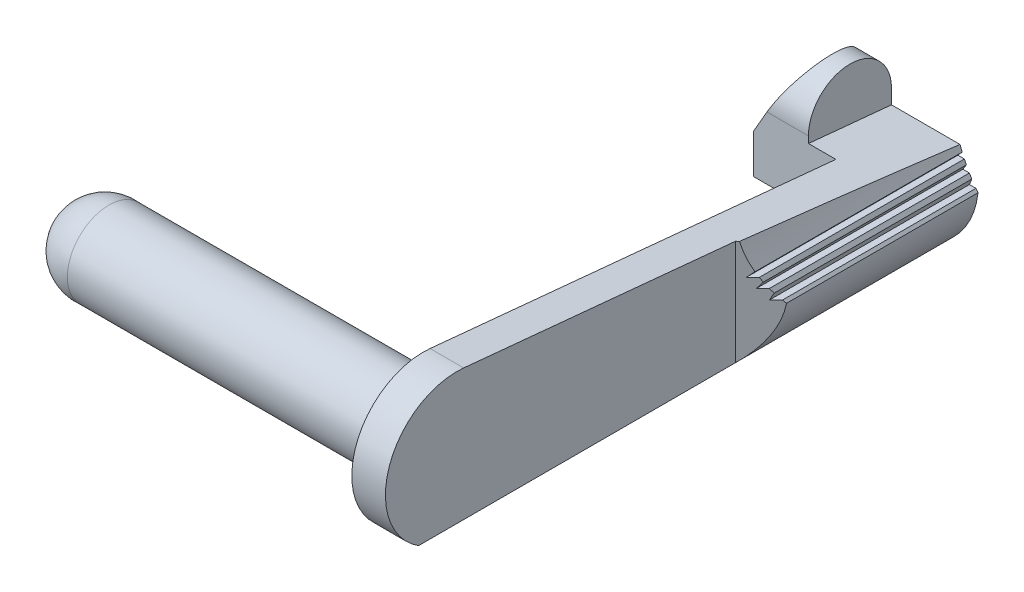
ISO-10303-21;
HEADER;
FILE_DESCRIPTION(('STEP AP214'),'2;1');
FILE_NAME('part.step','',(''),(''),'','','');
FILE_SCHEMA(('AUTOMOTIVE_DESIGN { 1 0 10303 214 1 1 1 1 }'));
ENDSEC;
DATA;
#1=APPLICATION_CONTEXT('core data for automotive mechanical design processes');
#2=APPLICATION_PROTOCOL_DEFINITION('international standard','automotive_design',2000,#1);
#3=PRODUCT_CONTEXT('',#1,'mechanical');
#4=PRODUCT('Part','Part','',(#3));
#5=PRODUCT_RELATED_PRODUCT_CATEGORY('part','',(#4));
#6=PRODUCT_DEFINITION_FORMATION('','',#4);
#7=PRODUCT_DEFINITION_CONTEXT('part definition',#1,'design');
#8=PRODUCT_DEFINITION('design','',#6,#7);
#9=PRODUCT_DEFINITION_SHAPE('','',#8);
#10=(LENGTH_UNIT() NAMED_UNIT(*) SI_UNIT(.MILLI.,.METRE.));
#11=(NAMED_UNIT(*) PLANE_ANGLE_UNIT() SI_UNIT($,.RADIAN.));
#12=(NAMED_UNIT(*) SI_UNIT($,.STERADIAN.) SOLID_ANGLE_UNIT());
#13=UNCERTAINTY_MEASURE_WITH_UNIT(LENGTH_MEASURE(1.E-05),#10,'distance_accuracy_value','');
#14=(GEOMETRIC_REPRESENTATION_CONTEXT(3) GLOBAL_UNCERTAINTY_ASSIGNED_CONTEXT((#13)) GLOBAL_UNIT_ASSIGNED_CONTEXT((#10,
#11,#12)) REPRESENTATION_CONTEXT('',''));
#15=CARTESIAN_POINT('',(0.,0.,0.));
#16=DIRECTION('',(0.,0.,1.));
#17=DIRECTION('',(1.,0.,0.));
#18=AXIS2_PLACEMENT_3D('',#15,#16,#17);
#19=CARTESIAN_POINT('',(9.6774,4.07663796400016,30.1909596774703));
#20=DIRECTION('',(0.,0.,-1.));
#21=DIRECTION('',(0.,1.,0.));
#22=AXIS2_PLACEMENT_3D('',#19,#20,#21);
#23=CYLINDRICAL_SURFACE('',#22,7.62);
#24=CARTESIAN_POINT('',(9.6774,4.07663796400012,-4.50544032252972));
#25=DIRECTION('',(0.,0.,-1.));
#26=DIRECTION('',(0.,1.,0.));
#27=AXIS2_PLACEMENT_3D('',#24,#25,#26);
#28=CIRCLE('',#27,7.62);
#29=CARTESIAN_POINT('',(3.61746422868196,-0.54305666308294,-4.50544032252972));
#30=VERTEX_POINT('',#29);
#31=CARTESIAN_POINT('',(3.49006067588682,-0.37097174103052,-4.50544032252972));
#32=VERTEX_POINT('',#31);
#33=EDGE_CURVE('E276',#30,#32,#28,.T.);
#34=ORIENTED_EDGE('',*,*,#33,.T.);
#35=DIRECTION('',(0.,0.,-1.));
#36=VECTOR('',#35,1.);
#37=CARTESIAN_POINT('',(3.49006067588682,-0.370971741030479,30.1909596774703));
#38=LINE('',#37,#36);
#39=CARTESIAN_POINT('',(3.49006067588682,-0.370971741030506,7.3353036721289));
#40=VERTEX_POINT('',#39);
#41=EDGE_CURVE('E11',#32,#40,#38,.F.);
#42=ORIENTED_EDGE('',*,*,#41,.T.);
#43=CARTESIAN_POINT('',(9.6774,4.07663796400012,1.14796434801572));
#44=DIRECTION('',(-0.707106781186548,0.,-0.707106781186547));
#45=DIRECTION('',(0.707106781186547,0.,-0.707106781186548));
#46=AXIS2_PLACEMENT_3D('',#43,#44,#45);
#47=ELLIPSE('',#46,10.776307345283,7.62);
#48=CARTESIAN_POINT('',(3.61746422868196,-0.543056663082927,7.20790011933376));
#49=VERTEX_POINT('',#48);
#50=EDGE_CURVE('E279',#49,#40,#47,.T.);
#51=ORIENTED_EDGE('',*,*,#50,.F.);
#52=DIRECTION('',(0.,0.,-1.));
#53=VECTOR('',#52,1.);
#54=CARTESIAN_POINT('',(3.61746422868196,-0.54305666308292,12.8427596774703));
#55=LINE('',#54,#53);
#56=EDGE_CURVE('E417',#30,#49,#55,.F.);
#57=ORIENTED_EDGE('',*,*,#56,.F.);
#58=EDGE_LOOP('',(#34,#42,#51,#57));
#59=FACE_BOUND('',#58,.T.);
#60=ADVANCED_FACE('F36',(#59),#23,.F.);
#61=CARTESIAN_POINT('',(2.90775602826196,0.578592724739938,7.91760831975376));
#62=VERTEX_POINT('',#61);
#63=CARTESIAN_POINT('',(2.78309680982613,0.831182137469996,8.04226753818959));
#64=VERTEX_POINT('',#63);
#65=EDGE_CURVE('E390',#62,#64,#47,.T.);
#66=ORIENTED_EDGE('',*,*,#65,.F.);
#67=DIRECTION('',(0.,0.,-1.));
#68=VECTOR('',#67,1.);
#69=CARTESIAN_POINT('',(2.90775602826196,0.578592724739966,30.1909596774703));
#70=LINE('',#69,#68);
#71=CARTESIAN_POINT('',(2.90775602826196,0.578592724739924,-4.50544032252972));
#72=VERTEX_POINT('',#71);
#73=EDGE_CURVE('E413',#62,#72,#70,.T.);
#74=ORIENTED_EDGE('',*,*,#73,.T.);
#75=CARTESIAN_POINT('',(2.78309680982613,0.831182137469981,-4.50544032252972));
#76=VERTEX_POINT('',#75);
#77=EDGE_CURVE('E402',#72,#76,#28,.T.);
#78=ORIENTED_EDGE('',*,*,#77,.T.);
#79=DIRECTION('',(0.,0.,-1.));
#80=VECTOR('',#79,1.);
#81=CARTESIAN_POINT('',(2.78309680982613,0.831182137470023,30.1909596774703));
#82=LINE('',#81,#80);
#83=EDGE_CURVE('E399',#76,#64,#82,.F.);
#84=ORIENTED_EDGE('',*,*,#83,.T.);
#85=EDGE_LOOP('',(#66,#74,#78,#84));
#86=FACE_BOUND('',#85,.T.);
#87=ADVANCED_FACE('F365',(#86),#23,.F.);
#88=CARTESIAN_POINT('',(2.65150743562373,1.12685260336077,8.17385691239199));
#89=VERTEX_POINT('',#88);
#90=CARTESIAN_POINT('',(2.1763646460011,2.73541888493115,8.64899970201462));
#91=VERTEX_POINT('',#90);
#92=EDGE_CURVE('E278',#89,#91,#47,.T.);
#93=ORIENTED_EDGE('',*,*,#92,.F.);
#94=DIRECTION('',(0.,0.,-1.));
#95=VECTOR('',#94,1.);
#96=CARTESIAN_POINT('',(2.65150743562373,1.1268526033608,30.1909596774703));
#97=LINE('',#96,#95);
#98=CARTESIAN_POINT('',(2.65150743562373,1.12685260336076,-4.50544032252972));
#99=VERTEX_POINT('',#98);
#100=EDGE_CURVE('E387',#89,#99,#97,.T.);
#101=ORIENTED_EDGE('',*,*,#100,.T.);
#102=CARTESIAN_POINT('',(2.51754448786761,1.46879037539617,-4.50544032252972));
#103=VERTEX_POINT('',#102);
#104=EDGE_CURVE('E275',#99,#103,#28,.T.);
#105=ORIENTED_EDGE('',*,*,#104,.T.);
#106=CARTESIAN_POINT('',(9.6774,4.07663796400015,22.5780924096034));
#107=DIRECTION('',(0.,-0.995396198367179,0.0958457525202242));
#108=DIRECTION('',(0.,-0.0958457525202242,-0.995396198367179));
#109=AXIS2_PLACEMENT_3D('',#106,#107,#108);
#110=ELLIPSE('',#109,79.5027405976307,7.62);
#111=EDGE_CURVE('E282',#91,#103,#110,.T.);
#112=ORIENTED_EDGE('',*,*,#111,.F.);
#113=EDGE_LOOP('',(#93,#101,#105,#112));
#114=FACE_BOUND('',#113,.T.);
#115=ADVANCED_FACE('F354',(#114),#23,.F.);
#116=CARTESIAN_POINT('',(0.,0.,25.8221596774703));
#117=DIRECTION('',(1.,0.,0.));
#118=DIRECTION('',(0.,0.,-1.));
#119=AXIS2_PLACEMENT_3D('',#116,#117,#118);
#120=PLANE('',#119);
#121=DIRECTION('',(0.,1.,0.));
#122=VECTOR('',#121,1.);
#123=CARTESIAN_POINT('',(0.,-27.9714846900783,0.574559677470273));
#124=LINE('',#123,#122);
#125=CARTESIAN_POINT('',(0.,-1.47252202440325,0.574559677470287));
#126=VERTEX_POINT('',#125);
#127=CARTESIAN_POINT('',(0.,1.95793874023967,0.574559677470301));
#128=VERTEX_POINT('',#127);
#129=EDGE_CURVE('E466',#126,#128,#124,.T.);
#130=ORIENTED_EDGE('',*,*,#129,.F.);
#131=DIRECTION('',(0.,0.0523359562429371,0.998629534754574));
#132=VECTOR('',#131,1.);
#133=CARTESIAN_POINT('',(0.,-0.903916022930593,11.424208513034));
#134=LINE('',#133,#132);
#135=CARTESIAN_POINT('',(0.,-1.73875354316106,-4.50544032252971));
#136=VERTEX_POINT('',#135);
#137=EDGE_CURVE('E463',#136,#126,#134,.T.);
#138=ORIENTED_EDGE('',*,*,#137,.F.);
#139=DIRECTION('',(0.,1.,0.));
#140=VECTOR('',#139,1.);
#141=CARTESIAN_POINT('',(0.,1.46879037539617,-4.50544032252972));
#142=LINE('',#141,#140);
#143=CARTESIAN_POINT('',(0.,-4.3688,-4.50544032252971));
#144=VERTEX_POINT('',#143);
#145=EDGE_CURVE('E456',#144,#136,#142,.T.);
#146=ORIENTED_EDGE('',*,*,#145,.F.);
#147=DIRECTION('',(0.,0.,-1.));
#148=VECTOR('',#147,1.);
#149=CARTESIAN_POINT('',(0.,-4.3688,25.8221596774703));
#150=LINE('',#149,#148);
#151=CARTESIAN_POINT('',(0.,-4.3688,25.8221596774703));
#152=VERTEX_POINT('',#151);
#153=EDGE_CURVE('E442',#152,#144,#150,.T.);
#154=ORIENTED_EDGE('',*,*,#153,.F.);
#155=CARTESIAN_POINT('',(0.,0.,25.8221596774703));
#156=DIRECTION('',(1.,0.,0.));
#157=DIRECTION('',(0.,0.,-1.));
#158=AXIS2_PLACEMENT_3D('',#155,#156,#157);
#159=CIRCLE('',#158,4.3688);
#160=CARTESIAN_POINT('',(0.,4.34868691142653,25.4034287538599));
#161=VERTEX_POINT('',#160);
#162=EDGE_CURVE('E429',#161,#152,#159,.T.);
#163=ORIENTED_EDGE('',*,*,#162,.F.);
#164=DIRECTION('',(0.,0.0958457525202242,0.995396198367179));
#165=VECTOR('',#164,1.);
#166=CARTESIAN_POINT('',(0.,4.34868691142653,25.4034287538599));
#167=LINE('',#166,#165);
#168=EDGE_CURVE('E459',#128,#161,#167,.T.);
#169=ORIENTED_EDGE('',*,*,#168,.F.);
#170=EDGE_LOOP('',(#130,#138,#146,#154,#163,#169));
#171=FACE_BOUND('',#170,.T.);
#172=CARTESIAN_POINT('',(0.,0.,25.8221596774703));
#173=DIRECTION('',(1.,0.,0.));
#174=DIRECTION('',(0.,0.,-1.));
#175=AXIS2_PLACEMENT_3D('',#172,#173,#174);
#176=CIRCLE('',#175,2.54635);
#177=CARTESIAN_POINT('',(0.,0.,23.2758096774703));
#178=VERTEX_POINT('',#177);
#179=EDGE_CURVE('E407',#178,#178,#176,.F.);
#180=ORIENTED_EDGE('',*,*,#179,.F.);
#181=EDGE_LOOP('',(#180));
#182=FACE_BOUND('',#181,.T.);
#183=ADVANCED_FACE('F352',(#171,#182),#120,.F.);
#184=CARTESIAN_POINT('',(2.0574,1.46879037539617,-4.50544032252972));
#185=DIRECTION('',(0.,0.,1.));
#186=DIRECTION('',(0.,-1.,0.));
#187=AXIS2_PLACEMENT_3D('',#184,#185,#186);
#188=PLANE('',#187);
#189=DIRECTION('',(0.373491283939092,0.927633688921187,0.));
#190=VECTOR('',#189,1.);
#191=CARTESIAN_POINT('',(1.32348125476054,-4.76363997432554,-4.50544032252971));
#192=LINE('',#191,#190);
#193=CARTESIAN_POINT('',(3.09209241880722,-0.37097174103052,-4.50544032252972));
#194=VERTEX_POINT('',#193);
#195=CARTESIAN_POINT('',(3.24073009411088,-0.00180297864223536,-4.50544032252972));
#196=VERTEX_POINT('',#195);
#197=EDGE_CURVE('E51',#194,#196,#192,.T.);
#198=ORIENTED_EDGE('',*,*,#197,.F.);
#199=DIRECTION('',(-1.,0.,0.));
#200=VECTOR('',#199,1.);
#201=CARTESIAN_POINT('',(-8.0160085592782,-0.370971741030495,-4.50544032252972));
#202=LINE('',#201,#200);
#203=EDGE_CURVE('E214',#32,#194,#202,.T.);
#204=ORIENTED_EDGE('',*,*,#203,.F.);
#205=ORIENTED_EDGE('',*,*,#33,.F.);
#206=CARTESIAN_POINT('',(-1.43319532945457,0.00213874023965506,-4.50544032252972));
#207=DIRECTION('',(0.,0.,1.));
#208=DIRECTION('',(0.,1.,0.));
#209=AXIS2_PLACEMENT_3D('',#206,#207,#208);
#210=CIRCLE('',#209,5.08);
#211=CARTESIAN_POINT('',(1.15549053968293,-4.3688,-4.50544032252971));
#212=VERTEX_POINT('',#211);
#213=EDGE_CURVE('E285',#212,#30,#210,.T.);
#214=ORIENTED_EDGE('',*,*,#213,.F.);
#215=DIRECTION('',(-1.,0.,0.));
#216=VECTOR('',#215,1.);
#217=CARTESIAN_POINT('',(2.0574,-4.3688,-4.50544032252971));
#218=LINE('',#217,#216);
#219=EDGE_CURVE('E424',#212,#144,#218,.T.);
#220=ORIENTED_EDGE('',*,*,#219,.T.);
#221=ORIENTED_EDGE('',*,*,#145,.T.);
#222=DIRECTION('',(1.,0.,0.));
#223=VECTOR('',#222,1.);
#224=CARTESIAN_POINT('',(-1.6764,-1.73875354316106,-4.50544032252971));
#225=LINE('',#224,#223);
#226=CARTESIAN_POINT('',(-1.6764,-1.73875354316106,-4.50544032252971));
#227=VERTEX_POINT('',#226);
#228=EDGE_CURVE('E470',#227,#136,#225,.T.);
#229=ORIENTED_EDGE('',*,*,#228,.F.);
#230=DIRECTION('',(0.,-1.,0.));
#231=VECTOR('',#230,1.);
#232=CARTESIAN_POINT('',(-1.6764,-27.9714846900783,-4.50544032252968));
#233=LINE('',#232,#231);
#234=CARTESIAN_POINT('',(-1.6764,-1.47252202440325,-4.50544032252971));
#235=VERTEX_POINT('',#234);
#236=EDGE_CURVE('E479',#235,#227,#233,.T.);
#237=ORIENTED_EDGE('',*,*,#236,.F.);
#238=DIRECTION('',(1.,0.,0.));
#239=VECTOR('',#238,1.);
#240=CARTESIAN_POINT('',(-5.0292,-1.47252202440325,-4.50544032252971));
#241=LINE('',#240,#239);
#242=CARTESIAN_POINT('',(-3.79303842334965,-1.47252202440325,-4.50544032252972));
#243=VERTEX_POINT('',#242);
#244=EDGE_CURVE('E512',#243,#235,#241,.T.);
#245=ORIENTED_EDGE('',*,*,#244,.F.);
#246=DIRECTION('',(0.,-1.,0.));
#247=VECTOR('',#246,1.);
#248=CARTESIAN_POINT('',(-3.79303842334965,3.3528,-4.50544032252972));
#249=LINE('',#248,#247);
#250=CARTESIAN_POINT('',(-3.79303842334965,2.3622,-4.50544032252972));
#251=VERTEX_POINT('',#250);
#252=EDGE_CURVE('E263',#251,#243,#249,.T.);
#253=ORIENTED_EDGE('',*,*,#252,.F.);
#254=DIRECTION('',(1.,0.,0.));
#255=VECTOR('',#254,1.);
#256=CARTESIAN_POINT('',(-5.0292,2.3622,-4.50544032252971));
#257=LINE('',#256,#255);
#258=CARTESIAN_POINT('',(-1.6764,2.3622,-4.50544032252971));
#259=VERTEX_POINT('',#258);
#260=EDGE_CURVE('E514',#251,#259,#257,.T.);
#261=ORIENTED_EDGE('',*,*,#260,.T.);
#262=DIRECTION('',(0.,-1.,0.));
#263=VECTOR('',#262,1.);
#264=CARTESIAN_POINT('',(-1.6764,-1.47252202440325,-4.50544032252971));
#265=LINE('',#264,#263);
#266=CARTESIAN_POINT('',(-1.6764,1.46879037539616,-4.50544032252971));
#267=VERTEX_POINT('',#266);
#268=EDGE_CURVE('E531',#259,#267,#265,.T.);
#269=ORIENTED_EDGE('',*,*,#268,.T.);
#270=DIRECTION('',(-1.,0.,0.));
#271=VECTOR('',#270,1.);
#272=CARTESIAN_POINT('',(2.0574,1.46879037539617,-4.50544032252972));
#273=LINE('',#272,#271);
#274=EDGE_CURVE('E433',#103,#267,#273,.T.);
#275=ORIENTED_EDGE('',*,*,#274,.F.);
#276=ORIENTED_EDGE('',*,*,#104,.F.);
#277=DIRECTION('',(0.669347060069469,0.742949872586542,0.));
#278=VECTOR('',#277,1.);
#279=CARTESIAN_POINT('',(-3.18711799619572,-5.35380037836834,-4.50544032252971));
#280=LINE('',#279,#278);
#281=CARTESIAN_POINT('',(2.38512855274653,0.831182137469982,-4.50544032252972));
#282=VERTEX_POINT('',#281);
#283=EDGE_CURVE('E244',#282,#99,#280,.T.);
#284=ORIENTED_EDGE('',*,*,#283,.F.);
#285=DIRECTION('',(-1.,0.,0.));
#286=VECTOR('',#285,1.);
#287=CARTESIAN_POINT('',(-8.0160085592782,0.831182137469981,-4.50544032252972));
#288=LINE('',#287,#286);
#289=EDGE_CURVE('E241',#76,#282,#288,.T.);
#290=ORIENTED_EDGE('',*,*,#289,.F.);
#291=ORIENTED_EDGE('',*,*,#77,.F.);
#292=DIRECTION('',(0.536806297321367,0.843705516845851,0.));
#293=VECTOR('',#292,1.);
#294=CARTESIAN_POINT('',(-0.956496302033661,-5.49490348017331,-4.50544032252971));
#295=LINE('',#294,#293);
#296=CARTESIAN_POINT('',(2.69412416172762,0.242824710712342,-4.50544032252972));
#297=VERTEX_POINT('',#296);
#298=EDGE_CURVE('E232',#297,#72,#295,.T.);
#299=ORIENTED_EDGE('',*,*,#298,.F.);
#300=DIRECTION('',(-1.,0.,0.));
#301=VECTOR('',#300,1.);
#302=CARTESIAN_POINT('',(-8.0160085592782,0.242824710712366,-4.50544032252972));
#303=LINE('',#302,#301);
#304=CARTESIAN_POINT('',(3.09209241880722,0.242824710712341,-4.50544032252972));
#305=VERTEX_POINT('',#304);
#306=EDGE_CURVE('E229',#305,#297,#303,.T.);
#307=ORIENTED_EDGE('',*,*,#306,.F.);
#308=EDGE_CURVE('E223',#196,#305,#28,.T.);
#309=ORIENTED_EDGE('',*,*,#308,.F.);
#310=EDGE_LOOP('',(#198,#204,#205,#214,#220,#221,#229,#237,#245,#253,#261,#269,#275,#276,#284,
#290,#291,#299,#307,#309));
#311=FACE_BOUND('',#310,.T.);
#312=ADVANCED_FACE('F221',(#311),#188,.F.);
#313=CARTESIAN_POINT('',(-5.0292,-1.47252202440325,0.574559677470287));
#314=DIRECTION('',(0.,1.,0.));
#315=DIRECTION('',(0.,0.,1.));
#316=AXIS2_PLACEMENT_3D('',#313,#314,#315);
#317=PLANE('',#316);
#318=DIRECTION('',(0.,0.,1.));
#319=VECTOR('',#318,1.);
#320=CARTESIAN_POINT('',(-5.0292,-1.47252202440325,0.574559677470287));
#321=LINE('',#320,#319);
#322=CARTESIAN_POINT('',(-5.0292,-1.47252202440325,-1.96544032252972));
#323=VERTEX_POINT('',#322);
#324=CARTESIAN_POINT('',(-5.0292,-1.47252202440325,0.574559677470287));
#325=VERTEX_POINT('',#324);
#326=EDGE_CURVE('E301',#323,#325,#321,.T.);
#327=ORIENTED_EDGE('',*,*,#326,.F.);
#328=DIRECTION('',(0.422618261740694,0.,-0.906307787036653));
#329=VECTOR('',#328,1.);
#330=CARTESIAN_POINT('',(-6.00207644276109,-1.47252202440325,0.120899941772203));
#331=LINE('',#330,#329);
#332=CARTESIAN_POINT('',(-3.90949779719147,-1.47252202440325,-4.36664944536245));
#333=VERTEX_POINT('',#332);
#334=EDGE_CURVE('E259',#323,#333,#331,.T.);
#335=ORIENTED_EDGE('',*,*,#334,.T.);
#336=DIRECTION('',(-0.642787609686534,0.,0.766044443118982));
#337=VECTOR('',#336,1.);
#338=CARTESIAN_POINT('',(-6.80520230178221,-1.47252202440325,-0.915683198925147));
#339=LINE('',#338,#337);
#340=EDGE_CURVE('E267',#243,#333,#339,.T.);
#341=ORIENTED_EDGE('',*,*,#340,.F.);
#342=ORIENTED_EDGE('',*,*,#244,.T.);
#343=DIRECTION('',(0.,0.,1.));
#344=VECTOR('',#343,1.);
#345=CARTESIAN_POINT('',(-1.6764,-1.47252202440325,0.574559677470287));
#346=LINE('',#345,#344);
#347=CARTESIAN_POINT('',(-1.6764,-1.47252202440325,0.574559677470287));
#348=VERTEX_POINT('',#347);
#349=EDGE_CURVE('E300',#235,#348,#346,.T.);
#350=ORIENTED_EDGE('',*,*,#349,.T.);
#351=DIRECTION('',(1.,0.,0.));
#352=VECTOR('',#351,1.);
#353=CARTESIAN_POINT('',(-5.0292,-1.47252202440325,0.574559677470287));
#354=LINE('',#353,#352);
#355=EDGE_CURVE('E467',#325,#348,#354,.T.);
#356=ORIENTED_EDGE('',*,*,#355,.F.);
#357=EDGE_LOOP('',(#327,#335,#341,#342,#350,#356));
#358=FACE_BOUND('',#357,.T.);
#359=ADVANCED_FACE('F328',(#358),#317,.F.);
#360=CARTESIAN_POINT('',(-5.0292,2.3622,-1.96544032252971));
#361=DIRECTION('',(1.,0.,0.));
#362=DIRECTION('',(0.,0.,-1.));
#363=AXIS2_PLACEMENT_3D('',#360,#361,#362);
#364=CYLINDRICAL_SURFACE('',#363,2.54);
#365=CARTESIAN_POINT('',(-5.92435148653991,2.3622,-1.96544032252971));
#366=DIRECTION('',(-0.766044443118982,0.,-0.642787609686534));
#367=DIRECTION('',(0.642787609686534,0.,-0.766044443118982));
#368=AXIS2_PLACEMENT_3D('',#365,#366,#367);
#369=ELLIPSE('',#368,3.31573451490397,2.54);
#370=CARTESIAN_POINT('',(-3.85691249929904,2.97937581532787,-4.42931816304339));
#371=VERTEX_POINT('',#370);
#372=EDGE_CURVE('E265',#371,#251,#369,.T.);
#373=ORIENTED_EDGE('',*,*,#372,.F.);
#374=CARTESIAN_POINT('',(-4.21323912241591,2.3622,-1.96544032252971));
#375=DIRECTION('',(0.866025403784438,-0.500000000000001,0.));
#376=DIRECTION('',(0.500000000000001,0.866025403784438,0.));
#377=AXIS2_PLACEMENT_3D('',#374,#375,#376);
#378=ELLIPSE('',#377,2.9329393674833,2.54);
#379=CARTESIAN_POINT('',(-4.21323912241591,2.3622,0.574559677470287));
#380=VERTEX_POINT('',#379);
#381=EDGE_CURVE('E270',#371,#380,#378,.T.);
#382=ORIENTED_EDGE('',*,*,#381,.T.);
#383=DIRECTION('',(1.,0.,0.));
#384=VECTOR('',#383,1.);
#385=CARTESIAN_POINT('',(-5.0292,2.3622,0.574559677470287));
#386=LINE('',#385,#384);
#387=CARTESIAN_POINT('',(-1.6764,2.3622,0.574559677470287));
#388=VERTEX_POINT('',#387);
#389=EDGE_CURVE('E540',#380,#388,#386,.T.);
#390=ORIENTED_EDGE('',*,*,#389,.T.);
#391=CARTESIAN_POINT('',(-1.6764,2.3622,-1.96544032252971));
#392=DIRECTION('',(-1.,0.,0.));
#393=DIRECTION('',(0.,0.,1.));
#394=AXIS2_PLACEMENT_3D('',#391,#392,#393);
#395=CIRCLE('',#394,2.54);
#396=EDGE_CURVE('E530',#388,#259,#395,.T.);
#397=ORIENTED_EDGE('',*,*,#396,.T.);
#398=ORIENTED_EDGE('',*,*,#260,.F.);
#399=EDGE_LOOP('',(#373,#382,#390,#397,#398));
#400=FACE_BOUND('',#399,.T.);
#401=ADVANCED_FACE('F320',(#400),#364,.T.);
#402=CARTESIAN_POINT('',(-5.0292,2.3622,-1.96544032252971));
#403=DIRECTION('',(-1.,0.,0.));
#404=DIRECTION('',(0.,0.,1.));
#405=AXIS2_PLACEMENT_3D('',#402,#403,#404);
#406=PLANE('',#405);
#407=DIRECTION('',(0.,1.,0.));
#408=VECTOR('',#407,1.);
#409=CARTESIAN_POINT('',(-5.0292,-4.368825,-1.96544032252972));
#410=LINE('',#409,#408);
#411=CARTESIAN_POINT('',(-5.0292,0.948914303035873,-1.96544032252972));
#412=VERTEX_POINT('',#411);
#413=EDGE_CURVE('E254',#323,#412,#410,.T.);
#414=ORIENTED_EDGE('',*,*,#413,.F.);
#415=ORIENTED_EDGE('',*,*,#326,.T.);
#416=DIRECTION('',(0.,1.,0.));
#417=VECTOR('',#416,1.);
#418=CARTESIAN_POINT('',(-5.0292,-1.47252202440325,0.574559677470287));
#419=LINE('',#418,#417);
#420=CARTESIAN_POINT('',(-5.0292,0.948914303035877,0.574559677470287));
#421=VERTEX_POINT('',#420);
#422=EDGE_CURVE('E515',#325,#421,#419,.T.);
#423=ORIENTED_EDGE('',*,*,#422,.T.);
#424=DIRECTION('',(0.,0.,1.));
#425=VECTOR('',#424,1.);
#426=CARTESIAN_POINT('',(-5.0292,0.948914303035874,-1.96544032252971));
#427=LINE('',#426,#425);
#428=EDGE_CURVE('E506',#412,#421,#427,.T.);
#429=ORIENTED_EDGE('',*,*,#428,.F.);
#430=EDGE_LOOP('',(#414,#415,#423,#429));
#431=FACE_BOUND('',#430,.T.);
#432=ADVANCED_FACE('F316',(#431),#406,.T.);
#433=CARTESIAN_POINT('',(-5.0292,0.948914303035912,30.1909596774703));
#434=DIRECTION('',(0.866025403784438,-0.500000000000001,0.));
#435=DIRECTION('',(0.500000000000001,0.866025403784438,0.));
#436=AXIS2_PLACEMENT_3D('',#433,#434,#435);
#437=PLANE('',#436);
#438=DIRECTION('',(0.429525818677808,0.743960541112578,-0.511888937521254));
#439=VECTOR('',#438,1.);
#440=CARTESIAN_POINT('',(-12.33396886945,-11.7033165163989,5.67324422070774));
#441=LINE('',#440,#439);
#442=CARTESIAN_POINT('',(-3.90949779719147,2.88829540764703,-4.36664944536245));
#443=VERTEX_POINT('',#442);
#444=EDGE_CURVE('E510',#443,#371,#441,.T.);
#445=ORIENTED_EDGE('',*,*,#444,.F.);
#446=DIRECTION('',(-0.341018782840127,-0.590661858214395,0.73131713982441));
#447=VECTOR('',#446,1.);
#448=CARTESIAN_POINT('',(-13.0487772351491,-12.941400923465,15.2325985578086));
#449=LINE('',#448,#447);
#450=EDGE_CURVE('E256',#443,#412,#449,.T.);
#451=ORIENTED_EDGE('',*,*,#450,.T.);
#452=ORIENTED_EDGE('',*,*,#428,.T.);
#453=DIRECTION('',(-0.500000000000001,-0.866025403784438,0.));
#454=VECTOR('',#453,1.);
#455=CARTESIAN_POINT('',(-16.7139001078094,-19.2895799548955,0.574559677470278));
#456=LINE('',#455,#454);
#457=EDGE_CURVE('E272',#380,#421,#456,.T.);
#458=ORIENTED_EDGE('',*,*,#457,.F.);
#459=ORIENTED_EDGE('',*,*,#381,.F.);
#460=EDGE_LOOP('',(#445,#451,#452,#458,#459));
#461=FACE_BOUND('',#460,.T.);
#462=ADVANCED_FACE('F319',(#461),#437,.F.);
#463=CARTESIAN_POINT('',(2.0574,4.34868691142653,25.4034287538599));
#464=DIRECTION('',(0.,-0.995396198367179,0.0958457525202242));
#465=DIRECTION('',(0.,-0.0958457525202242,-0.995396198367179));
#466=AXIS2_PLACEMENT_3D('',#463,#464,#465);
#467=PLANE('',#466);
#468=DIRECTION('',(-0.705473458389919,0.0679293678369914,0.705473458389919));
#469=VECTOR('',#468,1.);
#470=CARTESIAN_POINT('',(1.44590584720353,2.80575406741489,9.37945850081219));
#471=LINE('',#470,#469);
#472=CARTESIAN_POINT('',(2.0574,2.74687387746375,8.76796434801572));
#473=VERTEX_POINT('',#472);
#474=EDGE_CURVE('E460',#91,#473,#471,.T.);
#475=ORIENTED_EDGE('',*,*,#474,.F.);
#476=ORIENTED_EDGE('',*,*,#111,.T.);
#477=ORIENTED_EDGE('',*,*,#274,.T.);
#478=DIRECTION('',(0.,-0.0958457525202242,-0.995396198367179));
#479=VECTOR('',#478,1.);
#480=CARTESIAN_POINT('',(-1.6764,2.85343629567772,9.8746573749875));
#481=LINE('',#480,#479);
#482=CARTESIAN_POINT('',(-1.6764,1.95793874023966,0.57455967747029));
#483=VERTEX_POINT('',#482);
#484=EDGE_CURVE('E489',#483,#267,#481,.T.);
#485=ORIENTED_EDGE('',*,*,#484,.F.);
#486=DIRECTION('',(1.,0.,0.));
#487=VECTOR('',#486,1.);
#488=CARTESIAN_POINT('',(-1.6764,1.95793874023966,0.57455967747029));
#489=LINE('',#488,#487);
#490=EDGE_CURVE('E480',#483,#128,#489,.T.);
#491=ORIENTED_EDGE('',*,*,#490,.T.);
#492=ORIENTED_EDGE('',*,*,#168,.T.);
#493=DIRECTION('',(-1.,0.,0.));
#494=VECTOR('',#493,1.);
#495=CARTESIAN_POINT('',(2.0574,4.34868691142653,25.4034287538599));
#496=LINE('',#495,#494);
#497=CARTESIAN_POINT('',(2.0574,4.34868691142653,25.4034287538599));
#498=VERTEX_POINT('',#497);
#499=EDGE_CURVE('E431',#498,#161,#496,.T.);
#500=ORIENTED_EDGE('',*,*,#499,.F.);
#501=DIRECTION('',(0.,0.0958457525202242,0.995396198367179));
#502=VECTOR('',#501,1.);
#503=CARTESIAN_POINT('',(2.0574,4.34868691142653,25.4034287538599));
#504=LINE('',#503,#502);
#505=EDGE_CURVE('E439',#473,#498,#504,.T.);
#506=ORIENTED_EDGE('',*,*,#505,.F.);
#507=EDGE_LOOP('',(#475,#476,#477,#485,#491,#492,#500,#506));
#508=FACE_BOUND('',#507,.T.);
#509=ADVANCED_FACE('F361',(#508),#467,.F.);
#510=CARTESIAN_POINT('',(2.0574,0.,25.8221596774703));
#511=DIRECTION('',(-1.,0.,0.));
#512=DIRECTION('',(0.,0.,1.));
#513=AXIS2_PLACEMENT_3D('',#510,#511,#512);
#514=CYLINDRICAL_SURFACE('',#513,4.3688);
#515=DIRECTION('',(-1.,0.,0.));
#516=VECTOR('',#515,1.);
#517=CARTESIAN_POINT('',(2.0574,-4.3688,25.8221596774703));
#518=LINE('',#517,#516);
#519=CARTESIAN_POINT('',(1.15549053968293,-4.36879999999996,25.8221596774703));
#520=VERTEX_POINT('',#519);
#521=EDGE_CURVE('E422',#520,#152,#518,.T.);
#522=ORIENTED_EDGE('',*,*,#521,.F.);
#523=CARTESIAN_POINT('',(1.15549053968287,-4.3688,25.8221596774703));
#524=CARTESIAN_POINT('',(1.15542955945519,-4.3688183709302,25.8964032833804));
#525=CARTESIAN_POINT('',(1.15868460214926,-4.36690833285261,25.9706069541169));
#526=CARTESIAN_POINT('',(1.1713456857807,-4.35938170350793,26.1181403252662));
#527=CARTESIAN_POINT('',(1.18073822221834,-4.35377324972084,26.1914715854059));
#528=CARTESIAN_POINT('',(1.20502338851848,-4.33910380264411,26.3357650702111));
#529=CARTESIAN_POINT('',(1.21983599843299,-4.33009298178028,26.406746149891));
#530=CARTESIAN_POINT('',(1.25425900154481,-4.30882413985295,26.5470634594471));
#531=CARTESIAN_POINT('',(1.27387229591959,-4.29656415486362,26.6163986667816));
#532=CARTESIAN_POINT('',(1.32639920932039,-4.26311317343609,26.7824782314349));
#533=CARTESIAN_POINT('',(1.36141127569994,-4.24034609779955,26.878241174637));
#534=CARTESIAN_POINT('',(1.43755441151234,-4.18919747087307,27.0657409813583));
#535=CARTESIAN_POINT('',(1.47868874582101,-4.16081292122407,27.1574756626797));
#536=CARTESIAN_POINT('',(1.56561338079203,-4.09864428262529,27.3376367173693));
#537=CARTESIAN_POINT('',(1.61143363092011,-4.06482455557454,27.4260361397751));
#538=CARTESIAN_POINT('',(1.70609853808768,-3.99220669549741,27.5990969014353));
#539=CARTESIAN_POINT('',(1.75494381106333,-3.95340754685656,27.6837574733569));
#540=CARTESIAN_POINT('',(1.84603741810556,-3.87805507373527,27.8353646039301));
#541=CARTESIAN_POINT('',(1.8879870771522,-3.84225056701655,27.9028664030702));
#542=CARTESIAN_POINT('',(1.97237230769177,-3.76769770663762,28.0349761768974));
#543=CARTESIAN_POINT('',(2.01480122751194,-3.72897543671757,28.0996031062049));
#544=CARTESIAN_POINT('',(2.0574,-3.68868017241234,28.1631107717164));
#545=B_SPLINE_CURVE_WITH_KNOTS('',3,(#523,#524,#525,#526,#527,#528,#529,#530,#531,#532,#533,
#534,#535,#536,#537,#538,#539,#540,#541,#542,#543,#544),.UNSPECIFIED.,.F.,.F.,(4,2,2,2,2,2,2,2,
2,2,4),(0.,0.2225711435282,0.444654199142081,0.663582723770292,0.882643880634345,
1.19554153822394,1.50860665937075,1.82381522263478,2.13908817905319,2.4004973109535,
2.65979723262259),.UNSPECIFIED.);
#546=CARTESIAN_POINT('',(2.0574,-3.68868017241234,28.1631107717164));
#547=VERTEX_POINT('',#546);
#548=EDGE_CURVE('E292',#520,#547,#545,.T.);
#549=ORIENTED_EDGE('',*,*,#548,.T.);
#550=CARTESIAN_POINT('',(2.0574,0.,25.8221596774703));
#551=DIRECTION('',(1.,0.,0.));
#552=DIRECTION('',(0.,0.,-1.));
#553=AXIS2_PLACEMENT_3D('',#550,#551,#552);
#554=CIRCLE('',#553,4.3688);
#555=EDGE_CURVE('E435',#498,#547,#554,.T.);
#556=ORIENTED_EDGE('',*,*,#555,.F.);
#557=ORIENTED_EDGE('',*,*,#499,.T.);
#558=ORIENTED_EDGE('',*,*,#162,.T.);
#559=EDGE_LOOP('',(#522,#549,#556,#557,#558));
#560=FACE_BOUND('',#559,.T.);
#561=ADVANCED_FACE('F303',(#560),#514,.T.);
#562=CARTESIAN_POINT('',(2.0574,-4.3688,25.8221596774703));
#563=DIRECTION('',(0.,1.,0.));
#564=DIRECTION('',(0.,0.,1.));
#565=AXIS2_PLACEMENT_3D('',#562,#563,#564);
#566=PLANE('',#565);
#567=ORIENTED_EDGE('',*,*,#219,.F.);
#568=DIRECTION('',(0.,0.,-1.));
#569=VECTOR('',#568,1.);
#570=CARTESIAN_POINT('',(1.15549053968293,-4.36879999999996,30.1909596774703));
#571=LINE('',#570,#569);
#572=EDGE_CURVE('E288',#520,#212,#571,.T.);
#573=ORIENTED_EDGE('',*,*,#572,.F.);
#574=ORIENTED_EDGE('',*,*,#521,.T.);
#575=ORIENTED_EDGE('',*,*,#153,.T.);
#576=EDGE_LOOP('',(#567,#573,#574,#575));
#577=FACE_BOUND('',#576,.T.);
#578=ADVANCED_FACE('F350',(#577),#566,.F.);
#579=CARTESIAN_POINT('',(2.0574,0.,25.8221596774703));
#580=DIRECTION('',(1.,0.,0.));
#581=DIRECTION('',(0.,0.,-1.));
#582=AXIS2_PLACEMENT_3D('',#579,#580,#581);
#583=PLANE('',#582);
#584=DIRECTION('',(0.,0.,-1.));
#585=VECTOR('',#584,1.);
#586=CARTESIAN_POINT('',(2.0574,-3.68868017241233,30.1909596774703));
#587=LINE('',#586,#585);
#588=CARTESIAN_POINT('',(2.0574,-3.68868017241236,8.76796434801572));
#589=VERTEX_POINT('',#588);
#590=EDGE_CURVE('E290',#589,#547,#587,.F.);
#591=ORIENTED_EDGE('',*,*,#590,.F.);
#592=DIRECTION('',(0.,-1.,0.));
#593=VECTOR('',#592,1.);
#594=CARTESIAN_POINT('',(2.0574,15.506973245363,8.76796434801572));
#595=LINE('',#594,#593);
#596=EDGE_CURVE('E443',#473,#589,#595,.T.);
#597=ORIENTED_EDGE('',*,*,#596,.F.);
#598=ORIENTED_EDGE('',*,*,#505,.T.);
#599=ORIENTED_EDGE('',*,*,#555,.T.);
#600=EDGE_LOOP('',(#591,#597,#598,#599));
#601=FACE_BOUND('',#600,.T.);
#602=ADVANCED_FACE('F347',(#601),#583,.T.);
#603=CARTESIAN_POINT('',(2.0574,15.506973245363,8.76796434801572));
#604=DIRECTION('',(-0.707106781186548,0.,-0.707106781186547));
#605=DIRECTION('',(-0.707106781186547,0.,0.707106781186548));
#606=AXIS2_PLACEMENT_3D('',#603,#604,#605);
#607=PLANE('',#606);
#608=ORIENTED_EDGE('',*,*,#50,.T.);
#609=DIRECTION('',(-0.707106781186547,0.,0.707106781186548));
#610=VECTOR('',#609,1.);
#611=CARTESIAN_POINT('',(2.05739999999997,-0.3709717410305,8.76796434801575));
#612=LINE('',#611,#610);
#613=CARTESIAN_POINT('',(3.09209241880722,-0.370971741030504,7.7332719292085));
#614=VERTEX_POINT('',#613);
#615=EDGE_CURVE('E227',#40,#614,#612,.T.);
#616=ORIENTED_EDGE('',*,*,#615,.T.);
#617=DIRECTION('',(0.349884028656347,0.869000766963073,-0.349884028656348));
#618=VECTOR('',#617,1.);
#619=CARTESIAN_POINT('',(7.66644180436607,10.9902588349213,3.15892254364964));
#620=LINE('',#619,#618);
#621=CARTESIAN_POINT('',(3.24073009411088,-0.00180297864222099,7.58463425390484));
#622=VERTEX_POINT('',#621);
#623=EDGE_CURVE('E209',#614,#622,#620,.T.);
#624=ORIENTED_EDGE('',*,*,#623,.T.);
#625=CARTESIAN_POINT('',(3.09209241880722,0.242824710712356,7.7332719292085));
#626=VERTEX_POINT('',#625);
#627=EDGE_CURVE('E59',#622,#626,#47,.T.);
#628=ORIENTED_EDGE('',*,*,#627,.T.);
#629=DIRECTION('',(-0.707106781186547,0.,0.707106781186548));
#630=VECTOR('',#629,1.);
#631=CARTESIAN_POINT('',(2.05739999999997,0.24282471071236,8.76796434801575));
#632=LINE('',#631,#630);
#633=CARTESIAN_POINT('',(2.69412416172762,0.242824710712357,8.13124018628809));
#634=VERTEX_POINT('',#633);
#635=EDGE_CURVE('E236',#626,#634,#632,.T.);
#636=ORIENTED_EDGE('',*,*,#635,.T.);
#637=DIRECTION('',(0.472968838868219,0.743371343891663,-0.472968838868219));
#638=VECTOR('',#637,1.);
#639=CARTESIAN_POINT('',(7.77599897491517,8.23007418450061,3.04936537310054));
#640=LINE('',#639,#638);
#641=EDGE_CURVE('E238',#634,#62,#640,.T.);
#642=ORIENTED_EDGE('',*,*,#641,.T.);
#643=ORIENTED_EDGE('',*,*,#65,.T.);
#644=DIRECTION('',(-0.707106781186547,0.,0.707106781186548));
#645=VECTOR('',#644,1.);
#646=CARTESIAN_POINT('',(2.05739999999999,0.831182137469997,8.76796434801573));
#647=LINE('',#646,#645);
#648=CARTESIAN_POINT('',(2.38512855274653,0.831182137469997,8.44023579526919));
#649=VERTEX_POINT('',#648);
#650=EDGE_CURVE('E248',#64,#649,#647,.T.);
#651=ORIENTED_EDGE('',*,*,#650,.T.);
#652=DIRECTION('',(0.556241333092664,0.617406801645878,-0.556241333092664));
#653=VECTOR('',#652,1.);
#654=CARTESIAN_POINT('',(7.2223928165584,6.20036216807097,3.60297153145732));
#655=LINE('',#654,#653);
#656=EDGE_CURVE('E251',#649,#89,#655,.T.);
#657=ORIENTED_EDGE('',*,*,#656,.T.);
#658=ORIENTED_EDGE('',*,*,#92,.T.);
#659=ORIENTED_EDGE('',*,*,#474,.T.);
#660=ORIENTED_EDGE('',*,*,#596,.T.);
#661=CARTESIAN_POINT('',(-1.43319532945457,0.00213874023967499,12.2585596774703));
#662=DIRECTION('',(-0.707106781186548,0.,-0.707106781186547));
#663=DIRECTION('',(0.707106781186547,0.,-0.707106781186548));
#664=AXIS2_PLACEMENT_3D('',#661,#662,#663);
#665=ELLIPSE('',#664,7.18420489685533,5.08);
#666=EDGE_CURVE('E503',#589,#49,#665,.F.);
#667=ORIENTED_EDGE('',*,*,#666,.T.);
#668=EDGE_LOOP('',(#608,#616,#624,#628,#636,#642,#643,#651,#657,#658,#659,#660,#667));
#669=FACE_BOUND('',#668,.T.);
#670=ADVANCED_FACE('F343',(#669),#607,.F.);
#671=CARTESIAN_POINT('',(-1.6764,-0.903916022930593,11.424208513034));
#672=DIRECTION('',(0.,0.998629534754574,-0.0523359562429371));
#673=DIRECTION('',(0.,0.0523359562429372,0.998629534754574));
#674=AXIS2_PLACEMENT_3D('',#671,#672,#673);
#675=PLANE('',#674);
#676=ORIENTED_EDGE('',*,*,#137,.T.);
#677=DIRECTION('',(1.,0.,0.));
#678=VECTOR('',#677,1.);
#679=CARTESIAN_POINT('',(-1.6764,-1.47252202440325,0.574559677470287));
#680=LINE('',#679,#678);
#681=EDGE_CURVE('E473',#348,#126,#680,.T.);
#682=ORIENTED_EDGE('',*,*,#681,.F.);
#683=DIRECTION('',(0.,0.0523359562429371,0.998629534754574));
#684=VECTOR('',#683,1.);
#685=CARTESIAN_POINT('',(-1.6764,-0.903916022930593,11.424208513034));
#686=LINE('',#685,#684);
#687=EDGE_CURVE('E493',#227,#348,#686,.T.);
#688=ORIENTED_EDGE('',*,*,#687,.F.);
#689=ORIENTED_EDGE('',*,*,#228,.T.);
#690=EDGE_LOOP('',(#676,#682,#688,#689));
#691=FACE_BOUND('',#690,.T.);
#692=ADVANCED_FACE('F339',(#691),#675,.F.);
#693=CARTESIAN_POINT('',(-1.6764,-27.9714846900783,0.574559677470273));
#694=DIRECTION('',(0.,0.,-1.));
#695=DIRECTION('',(0.,1.,0.));
#696=AXIS2_PLACEMENT_3D('',#693,#694,#695);
#697=PLANE('',#696);
#698=ORIENTED_EDGE('',*,*,#389,.F.);
#699=ORIENTED_EDGE('',*,*,#457,.T.);
#700=ORIENTED_EDGE('',*,*,#422,.F.);
#701=ORIENTED_EDGE('',*,*,#355,.T.);
#702=ORIENTED_EDGE('',*,*,#681,.T.);
#703=ORIENTED_EDGE('',*,*,#129,.T.);
#704=ORIENTED_EDGE('',*,*,#490,.F.);
#705=DIRECTION('',(0.,1.,0.));
#706=VECTOR('',#705,1.);
#707=CARTESIAN_POINT('',(-1.6764,-1.47252202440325,0.574559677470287));
#708=LINE('',#707,#706);
#709=EDGE_CURVE('E522',#483,#388,#708,.T.);
#710=ORIENTED_EDGE('',*,*,#709,.T.);
#711=EDGE_LOOP('',(#698,#699,#700,#701,#702,#703,#704,#710));
#712=FACE_BOUND('',#711,.T.);
#713=ADVANCED_FACE('F335',(#712),#697,.F.);
#714=CARTESIAN_POINT('',(-1.6764,-27.9714846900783,12.8427596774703));
#715=DIRECTION('',(-1.,0.,0.));
#716=DIRECTION('',(0.,0.,1.));
#717=AXIS2_PLACEMENT_3D('',#714,#715,#716);
#718=PLANE('',#717);
#719=ORIENTED_EDGE('',*,*,#349,.F.);
#720=ORIENTED_EDGE('',*,*,#236,.T.);
#721=ORIENTED_EDGE('',*,*,#687,.T.);
#722=EDGE_LOOP('',(#719,#720,#721));
#723=FACE_BOUND('',#722,.T.);
#724=ADVANCED_FACE('F324',(#723),#718,.T.);
#725=CARTESIAN_POINT('',(-1.6764,2.3622,-1.96544032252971));
#726=DIRECTION('',(-1.,0.,0.));
#727=DIRECTION('',(0.,0.,1.));
#728=AXIS2_PLACEMENT_3D('',#725,#726,#727);
#729=PLANE('',#728);
#730=ORIENTED_EDGE('',*,*,#709,.F.);
#731=ORIENTED_EDGE('',*,*,#484,.T.);
#732=ORIENTED_EDGE('',*,*,#268,.F.);
#733=ORIENTED_EDGE('',*,*,#396,.F.);
#734=EDGE_LOOP('',(#730,#731,#732,#733));
#735=FACE_BOUND('',#734,.T.);
#736=ADVANCED_FACE('F313',(#735),#729,.F.);
#737=CARTESIAN_POINT('',(-1.43319532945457,0.00213874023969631,30.1909596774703));
#738=DIRECTION('',(0.,0.,-1.));
#739=DIRECTION('',(0.,1.,0.));
#740=AXIS2_PLACEMENT_3D('',#737,#738,#739);
#741=CYLINDRICAL_SURFACE('',#740,5.08);
#742=ORIENTED_EDGE('',*,*,#213,.T.);
#743=ORIENTED_EDGE('',*,*,#56,.T.);
#744=ORIENTED_EDGE('',*,*,#666,.F.);
#745=ORIENTED_EDGE('',*,*,#590,.T.);
#746=ORIENTED_EDGE('',*,*,#548,.F.);
#747=ORIENTED_EDGE('',*,*,#572,.T.);
#748=EDGE_LOOP('',(#742,#743,#744,#745,#746,#747));
#749=FACE_BOUND('',#748,.T.);
#750=ADVANCED_FACE('F307',(#749),#741,.T.);
#751=ORIENTED_EDGE('',*,*,#627,.F.);
#752=DIRECTION('',(0.,0.,-1.));
#753=VECTOR('',#752,1.);
#754=CARTESIAN_POINT('',(3.24073009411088,-0.00180297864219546,30.1909596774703));
#755=LINE('',#754,#753);
#756=EDGE_CURVE('E44',#622,#196,#755,.T.);
#757=ORIENTED_EDGE('',*,*,#756,.T.);
#758=ORIENTED_EDGE('',*,*,#308,.T.);
#759=DIRECTION('',(0.,0.,-1.));
#760=VECTOR('',#759,1.);
#761=CARTESIAN_POINT('',(3.09209241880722,0.242824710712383,30.1909596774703));
#762=LINE('',#761,#760);
#763=EDGE_CURVE('E405',#305,#626,#762,.F.);
#764=ORIENTED_EDGE('',*,*,#763,.T.);
#765=EDGE_LOOP('',(#751,#757,#758,#764));
#766=FACE_BOUND('',#765,.T.);
#767=ADVANCED_FACE('F312',(#766),#23,.F.);
#768=CARTESIAN_POINT('',(-5.0292,3.3528,-3.03224032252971));
#769=DIRECTION('',(-0.766044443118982,0.,-0.642787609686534));
#770=DIRECTION('',(-0.642787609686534,0.,0.766044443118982));
#771=AXIS2_PLACEMENT_3D('',#768,#769,#770);
#772=PLANE('',#771);
#773=DIRECTION('',(0.,-1.,0.));
#774=VECTOR('',#773,1.);
#775=CARTESIAN_POINT('',(-3.90949779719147,3.3528,-4.36664944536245));
#776=LINE('',#775,#774);
#777=EDGE_CURVE('E403',#443,#333,#776,.T.);
#778=ORIENTED_EDGE('',*,*,#777,.F.);
#779=ORIENTED_EDGE('',*,*,#444,.T.);
#780=ORIENTED_EDGE('',*,*,#372,.T.);
#781=ORIENTED_EDGE('',*,*,#252,.T.);
#782=ORIENTED_EDGE('',*,*,#340,.T.);
#783=EDGE_LOOP('',(#778,#779,#780,#781,#782));
#784=FACE_BOUND('',#783,.T.);
#785=ADVANCED_FACE('F372',(#784),#772,.T.);
#786=CARTESIAN_POINT('',(-19.2278,0.,25.8221596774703));
#787=DIRECTION('',(1.,0.,0.));
#788=DIRECTION('',(0.,0.,-1.));
#789=AXIS2_PLACEMENT_3D('',#786,#787,#788);
#790=CYLINDRICAL_SURFACE('',#789,2.54635);
#791=CARTESIAN_POINT('',(-19.2278,0.,25.8221596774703));
#792=DIRECTION('',(-1.,0.,0.));
#793=DIRECTION('',(0.,0.,1.));
#794=AXIS2_PLACEMENT_3D('',#791,#792,#793);
#795=CIRCLE('',#794,2.54635);
#796=CARTESIAN_POINT('',(-19.2278,0.,28.3685096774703));
#797=VERTEX_POINT('',#796);
#798=EDGE_CURVE('E262',#797,#797,#795,.T.);
#799=ORIENTED_EDGE('',*,*,#798,.F.);
#800=EDGE_LOOP('',(#799));
#801=FACE_BOUND('',#800,.T.);
#802=ORIENTED_EDGE('',*,*,#179,.T.);
#803=EDGE_LOOP('',(#802));
#804=FACE_BOUND('',#803,.T.);
#805=ADVANCED_FACE('F377',(#801,#804),#790,.T.);
#806=CARTESIAN_POINT('',(-19.4644746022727,0.,25.8221596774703));
#807=DIRECTION('',(0.,0.,1.));
#808=DIRECTION('',(1.,0.,0.));
#809=AXIS2_PLACEMENT_3D('',#806,#807,#808);
#810=SPHERICAL_SURFACE('',#809,2.55732539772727);
#811=CARTESIAN_POINT('',(-19.4644746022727,0.,25.8221596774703));
#812=DIRECTION('',(-1.,0.,0.));
#813=DIRECTION('',(0.,0.,1.));
#814=AXIS2_PLACEMENT_3D('',#811,#812,#813);
#815=SPHERICAL_SURFACE('',#814,2.55732539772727);
#816=ORIENTED_EDGE('',*,*,#798,.T.);
#817=EDGE_LOOP('',(#816));
#818=FACE_BOUND('',#817,.T.);
#819=ADVANCED_FACE('F38',(#818),#815,.T.);
#820=CARTESIAN_POINT('',(-3.90949779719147,-4.368825,-4.36664944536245));
#821=DIRECTION('',(0.906307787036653,0.,0.422618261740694));
#822=DIRECTION('',(0.422618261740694,0.,-0.906307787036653));
#823=AXIS2_PLACEMENT_3D('',#820,#821,#822);
#824=PLANE('',#823);
#825=ORIENTED_EDGE('',*,*,#413,.T.);
#826=ORIENTED_EDGE('',*,*,#450,.F.);
#827=ORIENTED_EDGE('',*,*,#777,.T.);
#828=ORIENTED_EDGE('',*,*,#334,.F.);
#829=EDGE_LOOP('',(#825,#826,#827,#828));
#830=FACE_BOUND('',#829,.T.);
#831=ADVANCED_FACE('F566',(#830),#824,.F.);
#832=CARTESIAN_POINT('',(-3.18711799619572,-5.35380037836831,17.5163596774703));
#833=DIRECTION('',(-0.742949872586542,0.669347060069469,0.));
#834=DIRECTION('',(-0.669347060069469,-0.742949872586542,0.));
#835=AXIS2_PLACEMENT_3D('',#832,#833,#834);
#836=PLANE('',#835);
#837=DIRECTION('',(0.,0.,-1.));
#838=VECTOR('',#837,1.);
#839=CARTESIAN_POINT('',(2.38512855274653,0.831182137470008,17.5163596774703));
#840=LINE('',#839,#838);
#841=EDGE_CURVE('E246',#649,#282,#840,.T.);
#842=ORIENTED_EDGE('',*,*,#841,.T.);
#843=ORIENTED_EDGE('',*,*,#283,.T.);
#844=ORIENTED_EDGE('',*,*,#100,.F.);
#845=ORIENTED_EDGE('',*,*,#656,.F.);
#846=EDGE_LOOP('',(#842,#843,#844,#845));
#847=FACE_BOUND('',#846,.T.);
#848=ADVANCED_FACE('F578',(#847),#836,.F.);
#849=CARTESIAN_POINT('',(-8.0160085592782,0.831182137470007,17.5163596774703));
#850=DIRECTION('',(0.,-1.,0.));
#851=DIRECTION('',(0.,0.,-1.));
#852=AXIS2_PLACEMENT_3D('',#849,#850,#851);
#853=PLANE('',#852);
#854=ORIENTED_EDGE('',*,*,#83,.F.);
#855=ORIENTED_EDGE('',*,*,#289,.T.);
#856=ORIENTED_EDGE('',*,*,#841,.F.);
#857=ORIENTED_EDGE('',*,*,#650,.F.);
#858=EDGE_LOOP('',(#854,#855,#856,#857));
#859=FACE_BOUND('',#858,.T.);
#860=ADVANCED_FACE('F398',(#859),#853,.F.);
#861=CARTESIAN_POINT('',(-0.956496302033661,-5.49490348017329,17.5163596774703));
#862=DIRECTION('',(-0.843705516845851,0.536806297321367,0.));
#863=DIRECTION('',(-0.536806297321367,-0.843705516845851,0.));
#864=AXIS2_PLACEMENT_3D('',#861,#862,#863);
#865=PLANE('',#864);
#866=DIRECTION('',(0.,0.,-1.));
#867=VECTOR('',#866,1.);
#868=CARTESIAN_POINT('',(2.69412416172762,0.242824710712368,17.5163596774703));
#869=LINE('',#868,#867);
#870=EDGE_CURVE('E234',#634,#297,#869,.T.);
#871=ORIENTED_EDGE('',*,*,#870,.T.);
#872=ORIENTED_EDGE('',*,*,#298,.T.);
#873=ORIENTED_EDGE('',*,*,#73,.F.);
#874=ORIENTED_EDGE('',*,*,#641,.F.);
#875=EDGE_LOOP('',(#871,#872,#873,#874));
#876=FACE_BOUND('',#875,.T.);
#877=ADVANCED_FACE('F581',(#876),#865,.F.);
#878=CARTESIAN_POINT('',(-8.0160085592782,0.242824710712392,17.5163596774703));
#879=DIRECTION('',(0.,-1.,0.));
#880=DIRECTION('',(1.,0.,0.));
#881=AXIS2_PLACEMENT_3D('',#878,#879,#880);
#882=PLANE('',#881);
#883=ORIENTED_EDGE('',*,*,#763,.F.);
#884=ORIENTED_EDGE('',*,*,#306,.T.);
#885=ORIENTED_EDGE('',*,*,#870,.F.);
#886=ORIENTED_EDGE('',*,*,#635,.F.);
#887=EDGE_LOOP('',(#883,#884,#885,#886));
#888=FACE_BOUND('',#887,.T.);
#889=ADVANCED_FACE('F585',(#888),#882,.F.);
#890=CARTESIAN_POINT('',(-8.0160085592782,-0.370971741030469,17.5163596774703));
#891=DIRECTION('',(0.,-1.,0.));
#892=DIRECTION('',(1.,0.,0.));
#893=AXIS2_PLACEMENT_3D('',#890,#891,#892);
#894=PLANE('',#893);
#895=ORIENTED_EDGE('',*,*,#41,.F.);
#896=ORIENTED_EDGE('',*,*,#203,.T.);
#897=DIRECTION('',(0.,0.,-1.));
#898=VECTOR('',#897,1.);
#899=CARTESIAN_POINT('',(3.09209241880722,-0.370971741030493,17.5163596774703));
#900=LINE('',#899,#898);
#901=EDGE_CURVE('E206',#614,#194,#900,.T.);
#902=ORIENTED_EDGE('',*,*,#901,.F.);
#903=ORIENTED_EDGE('',*,*,#615,.F.);
#904=EDGE_LOOP('',(#895,#896,#902,#903));
#905=FACE_BOUND('',#904,.T.);
#906=ADVANCED_FACE('F215',(#905),#894,.F.);
#907=CARTESIAN_POINT('',(1.32348125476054,-4.76363997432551,17.5163596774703));
#908=DIRECTION('',(-0.927633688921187,0.373491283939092,0.));
#909=DIRECTION('',(-0.373491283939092,-0.927633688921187,0.));
#910=AXIS2_PLACEMENT_3D('',#907,#908,#909);
#911=PLANE('',#910);
#912=ORIENTED_EDGE('',*,*,#901,.T.);
#913=ORIENTED_EDGE('',*,*,#197,.T.);
#914=ORIENTED_EDGE('',*,*,#756,.F.);
#915=ORIENTED_EDGE('',*,*,#623,.F.);
#916=EDGE_LOOP('',(#912,#913,#914,#915));
#917=FACE_BOUND('',#916,.T.);
#918=ADVANCED_FACE('F208',(#917),#911,.F.);
#919=CLOSED_SHELL('',(#60,#87,#115,#183,#312,#359,#401,#432,#462,#509,#561,#578,#602,#670,#692,
#713,#724,#736,#750,#767,#785,#805,#819,#831,#848,#860,#877,#889,#906,#918));
#920=MANIFOLD_SOLID_BREP('B2',#919);
#921=ADVANCED_BREP_SHAPE_REPRESENTATION('',(#18,#920),#14);
#922=SHAPE_DEFINITION_REPRESENTATION(#9,#921);
ENDSEC;
END-ISO-10303-21;
